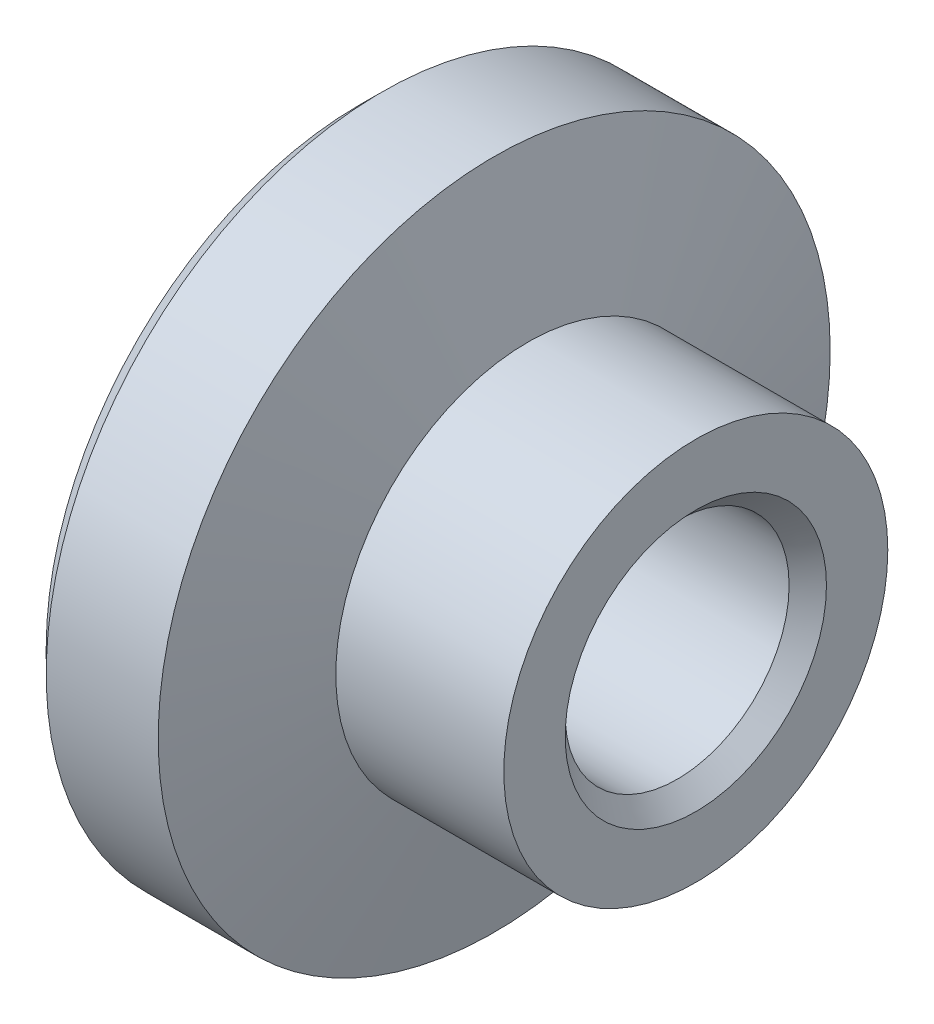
ISO-10303-21;
HEADER;
FILE_DESCRIPTION(('STEP AP214'),'2;1');
FILE_NAME('part.step','',(''),(''),'','','');
FILE_SCHEMA(('AUTOMOTIVE_DESIGN { 1 0 10303 214 1 1 1 1 }'));
ENDSEC;
DATA;
#1=APPLICATION_CONTEXT('core data for automotive mechanical design processes');
#2=APPLICATION_PROTOCOL_DEFINITION('international standard','automotive_design',2000,#1);
#3=PRODUCT_CONTEXT('',#1,'mechanical');
#4=PRODUCT('Part','Part','',(#3));
#5=PRODUCT_RELATED_PRODUCT_CATEGORY('part','',(#4));
#6=PRODUCT_DEFINITION_FORMATION('','',#4);
#7=PRODUCT_DEFINITION_CONTEXT('part definition',#1,'design');
#8=PRODUCT_DEFINITION('design','',#6,#7);
#9=PRODUCT_DEFINITION_SHAPE('','',#8);
#10=(LENGTH_UNIT() NAMED_UNIT(*) SI_UNIT(.MILLI.,.METRE.));
#11=(NAMED_UNIT(*) PLANE_ANGLE_UNIT() SI_UNIT($,.RADIAN.));
#12=(NAMED_UNIT(*) SI_UNIT($,.STERADIAN.) SOLID_ANGLE_UNIT());
#13=UNCERTAINTY_MEASURE_WITH_UNIT(LENGTH_MEASURE(1.E-05),#10,'distance_accuracy_value','');
#14=(GEOMETRIC_REPRESENTATION_CONTEXT(3) GLOBAL_UNCERTAINTY_ASSIGNED_CONTEXT((#13)) GLOBAL_UNIT_ASSIGNED_CONTEXT((#10,
#11,#12)) REPRESENTATION_CONTEXT('',''));
#15=CARTESIAN_POINT('',(0.,0.,0.));
#16=DIRECTION('',(0.,0.,1.));
#17=DIRECTION('',(1.,0.,0.));
#18=AXIS2_PLACEMENT_3D('',#15,#16,#17);
#19=CARTESIAN_POINT('',(0.,0.,0.));
#20=DIRECTION('',(1.,0.,0.));
#21=DIRECTION('',(0.,0.,-1.));
#22=AXIS2_PLACEMENT_3D('',#19,#20,#21);
#23=PLANE('',#22);
#24=CARTESIAN_POINT('',(0.,0.,0.));
#25=DIRECTION('',(1.,0.,0.));
#26=DIRECTION('',(0.,0.,-1.));
#27=AXIS2_PLACEMENT_3D('',#24,#25,#26);
#28=CIRCLE('',#27,8.4);
#29=CARTESIAN_POINT('',(0.,0.,-8.4));
#30=VERTEX_POINT('',#29);
#31=EDGE_CURVE('E8',#30,#30,#28,.T.);
#32=ORIENTED_EDGE('',*,*,#31,.F.);
#33=EDGE_LOOP('',(#32));
#34=FACE_BOUND('',#33,.T.);
#35=ADVANCED_FACE('F12',(#34),#23,.F.);
#36=CARTESIAN_POINT('',(0.,0.,0.));
#37=DIRECTION('',(1.,0.,0.));
#38=DIRECTION('',(0.,0.,-1.));
#39=AXIS2_PLACEMENT_3D('',#36,#37,#38);
#40=CONICAL_SURFACE('',#39,8.4,0.785398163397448);
#41=CARTESIAN_POINT('',(0.6,0.,0.));
#42=DIRECTION('',(1.,0.,0.));
#43=DIRECTION('',(0.,0.,-1.));
#44=AXIS2_PLACEMENT_3D('',#41,#42,#43);
#45=CIRCLE('',#44,9.);
#46=CARTESIAN_POINT('',(0.6,0.,-9.));
#47=VERTEX_POINT('',#46);
#48=EDGE_CURVE('E18',#47,#47,#45,.T.);
#49=ORIENTED_EDGE('',*,*,#48,.F.);
#50=EDGE_LOOP('',(#49));
#51=FACE_BOUND('',#50,.T.);
#52=ORIENTED_EDGE('',*,*,#31,.T.);
#53=EDGE_LOOP('',(#52));
#54=FACE_BOUND('',#53,.T.);
#55=ADVANCED_FACE('F78',(#51,#54),#40,.T.);
#56=CARTESIAN_POINT('',(9.,0.,0.));
#57=DIRECTION('',(1.,0.,0.));
#58=DIRECTION('',(0.,0.,-1.));
#59=AXIS2_PLACEMENT_3D('',#56,#57,#58);
#60=CYLINDRICAL_SURFACE('',#59,9.);
#61=CARTESIAN_POINT('',(3.6,0.,0.));
#62=DIRECTION('',(1.,0.,0.));
#63=DIRECTION('',(0.,0.,-1.));
#64=AXIS2_PLACEMENT_3D('',#61,#62,#63);
#65=CIRCLE('',#64,9.);
#66=CARTESIAN_POINT('',(3.6,0.,-9.));
#67=VERTEX_POINT('',#66);
#68=EDGE_CURVE('E22',#67,#67,#65,.T.);
#69=ORIENTED_EDGE('',*,*,#68,.F.);
#70=EDGE_LOOP('',(#69));
#71=FACE_BOUND('',#70,.T.);
#72=ORIENTED_EDGE('',*,*,#48,.T.);
#73=EDGE_LOOP('',(#72));
#74=FACE_BOUND('',#73,.T.);
#75=ADVANCED_FACE('F73',(#71,#74),#60,.T.);
#76=CARTESIAN_POINT('',(3.6,0.,0.));
#77=DIRECTION('',(-1.,0.,0.));
#78=DIRECTION('',(0.,0.,1.));
#79=AXIS2_PLACEMENT_3D('',#76,#77,#78);
#80=CONICAL_SURFACE('',#79,9.,1.3415643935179);
#81=CARTESIAN_POINT('',(4.5,0.,0.));
#82=DIRECTION('',(1.,0.,0.));
#83=DIRECTION('',(0.,0.,-1.));
#84=AXIS2_PLACEMENT_3D('',#81,#82,#83);
#85=CIRCLE('',#84,5.14285714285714);
#86=CARTESIAN_POINT('',(4.5,0.,-5.14285714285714));
#87=VERTEX_POINT('',#86);
#88=EDGE_CURVE('E26',#87,#87,#85,.T.);
#89=ORIENTED_EDGE('',*,*,#88,.F.);
#90=EDGE_LOOP('',(#89));
#91=FACE_BOUND('',#90,.T.);
#92=ORIENTED_EDGE('',*,*,#68,.T.);
#93=EDGE_LOOP('',(#92));
#94=FACE_BOUND('',#93,.T.);
#95=ADVANCED_FACE('F67',(#91,#94),#80,.T.);
#96=CARTESIAN_POINT('',(9.,0.,0.));
#97=DIRECTION('',(1.,0.,0.));
#98=DIRECTION('',(0.,0.,-1.));
#99=AXIS2_PLACEMENT_3D('',#96,#97,#98);
#100=CYLINDRICAL_SURFACE('',#99,5.14285714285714);
#101=CARTESIAN_POINT('',(9.,0.,0.));
#102=DIRECTION('',(1.,0.,0.));
#103=DIRECTION('',(0.,0.,-1.));
#104=AXIS2_PLACEMENT_3D('',#101,#102,#103);
#105=CIRCLE('',#104,5.14285714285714);
#106=CARTESIAN_POINT('',(9.,0.,-5.14285714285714));
#107=VERTEX_POINT('',#106);
#108=EDGE_CURVE('E31',#107,#107,#105,.T.);
#109=ORIENTED_EDGE('',*,*,#108,.F.);
#110=EDGE_LOOP('',(#109));
#111=FACE_BOUND('',#110,.T.);
#112=ORIENTED_EDGE('',*,*,#88,.T.);
#113=EDGE_LOOP('',(#112));
#114=FACE_BOUND('',#113,.T.);
#115=ADVANCED_FACE('F61',(#111,#114),#100,.T.);
#116=CARTESIAN_POINT('',(9.,5.14285714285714,0.));
#117=DIRECTION('',(-1.,0.,0.));
#118=DIRECTION('',(0.,0.,1.));
#119=AXIS2_PLACEMENT_3D('',#116,#117,#118);
#120=PLANE('',#119);
#121=CARTESIAN_POINT('',(9.,0.,0.));
#122=DIRECTION('',(1.,0.,0.));
#123=DIRECTION('',(0.,0.,-1.));
#124=AXIS2_PLACEMENT_3D('',#121,#122,#123);
#125=CIRCLE('',#124,3.5);
#126=CARTESIAN_POINT('',(9.,0.,-3.5));
#127=VERTEX_POINT('',#126);
#128=EDGE_CURVE('E34',#127,#127,#125,.T.);
#129=ORIENTED_EDGE('',*,*,#128,.F.);
#130=EDGE_LOOP('',(#129));
#131=FACE_BOUND('',#130,.T.);
#132=ORIENTED_EDGE('',*,*,#108,.T.);
#133=EDGE_LOOP('',(#132));
#134=FACE_BOUND('',#133,.T.);
#135=ADVANCED_FACE('F55',(#131,#134),#120,.F.);
#136=CARTESIAN_POINT('',(9.,0.,0.));
#137=DIRECTION('',(1.,0.,0.));
#138=DIRECTION('',(0.,0.,-1.));
#139=AXIS2_PLACEMENT_3D('',#136,#137,#138);
#140=CONICAL_SURFACE('',#139,3.5,0.785398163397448);
#141=CARTESIAN_POINT('',(8.5,0.,0.));
#142=DIRECTION('',(1.,0.,0.));
#143=DIRECTION('',(0.,0.,-1.));
#144=AXIS2_PLACEMENT_3D('',#141,#142,#143);
#145=CIRCLE('',#144,3.);
#146=CARTESIAN_POINT('',(8.5,0.,-3.));
#147=VERTEX_POINT('',#146);
#148=EDGE_CURVE('E37',#147,#147,#145,.T.);
#149=ORIENTED_EDGE('',*,*,#148,.F.);
#150=EDGE_LOOP('',(#149));
#151=FACE_BOUND('',#150,.T.);
#152=ORIENTED_EDGE('',*,*,#128,.T.);
#153=EDGE_LOOP('',(#152));
#154=FACE_BOUND('',#153,.T.);
#155=ADVANCED_FACE('F49',(#151,#154),#140,.F.);
#156=CARTESIAN_POINT('',(9.,0.,0.));
#157=DIRECTION('',(1.,0.,0.));
#158=DIRECTION('',(0.,0.,-1.));
#159=AXIS2_PLACEMENT_3D('',#156,#157,#158);
#160=CYLINDRICAL_SURFACE('',#159,3.);
#161=CARTESIAN_POINT('',(4.,0.,0.));
#162=DIRECTION('',(1.,0.,0.));
#163=DIRECTION('',(0.,0.,-1.));
#164=AXIS2_PLACEMENT_3D('',#161,#162,#163);
#165=CIRCLE('',#164,3.);
#166=CARTESIAN_POINT('',(4.,0.,-3.));
#167=VERTEX_POINT('',#166);
#168=EDGE_CURVE('E40',#167,#167,#165,.T.);
#169=ORIENTED_EDGE('',*,*,#168,.F.);
#170=EDGE_LOOP('',(#169));
#171=FACE_BOUND('',#170,.T.);
#172=ORIENTED_EDGE('',*,*,#148,.T.);
#173=EDGE_LOOP('',(#172));
#174=FACE_BOUND('',#173,.T.);
#175=ADVANCED_FACE('F46',(#171,#174),#160,.F.);
#176=CARTESIAN_POINT('',(4.,3.,0.));
#177=DIRECTION('',(-1.,0.,0.));
#178=DIRECTION('',(0.,0.,1.));
#179=AXIS2_PLACEMENT_3D('',#176,#177,#178);
#180=PLANE('',#179);
#181=ORIENTED_EDGE('',*,*,#168,.T.);
#182=EDGE_LOOP('',(#181));
#183=FACE_BOUND('',#182,.T.);
#184=ADVANCED_FACE('F44',(#183),#180,.F.);
#185=CLOSED_SHELL('',(#35,#55,#75,#95,#115,#135,#155,#175,#184));
#186=MANIFOLD_SOLID_BREP('B1',#185);
#187=ADVANCED_BREP_SHAPE_REPRESENTATION('',(#18,#186),#14);
#188=SHAPE_DEFINITION_REPRESENTATION(#9,#187);
ENDSEC;
END-ISO-10303-21;
